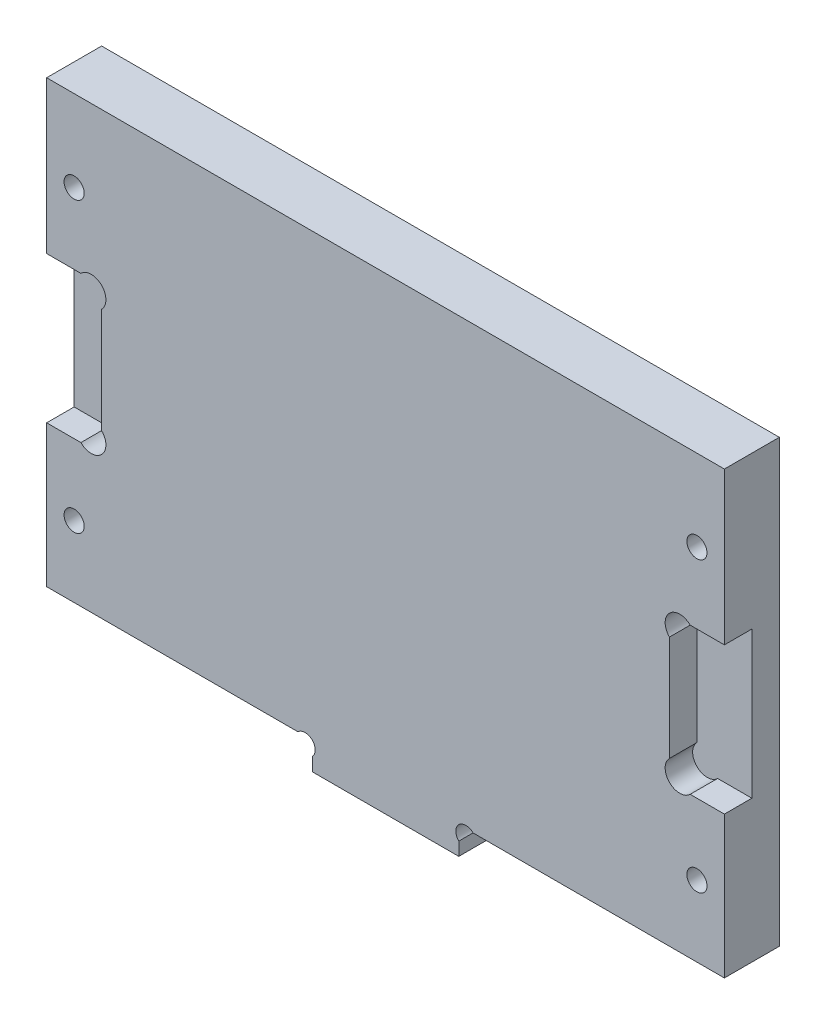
from build123d import *

# Parameters (mm, degrees)
ESQUISSE1_R             = 1.1
BOSS_EXTRU_1_DEPTH      = 6
ENL_V_MAT_EXTRU_1_DEPTH = 3


with BuildPart() as part:
    # Esquisse1 → Boss.-Extru.1 (new body)
    with BuildSketch(Plane.XY):
        with BuildLine():
            Line((0, 51.13), (74, 51.13))
            Line((74, 51.13), (74, 3))
            Line((74, 3), (46.555634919, 3))
            ThreePointArc((46.555634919, 3), (45, 3), (45, 1.444365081))
            Line((45, 1.444365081), (45, 0))
            Line((45, 0), (29, 0))
            Line((29, 0), (29, 1.444365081))
            ThreePointArc((29, 1.444365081), (29, 3), (27.444365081, 3))
            Line((27.444365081, 3), (0, 3))
            Line((0, 3), (0, 51.13))
        make_face()
        with Locations((71, 10.75)):
            Circle(ESQUISSE1_R, mode=Mode.SUBTRACT)
        with Locations(Location((71, 42.25, 0), (0, 0, 180))):
            Circle(ESQUISSE1_R, mode=Mode.SUBTRACT)
        with Locations(Location((3, 10.75, 0), (0, 0, 180))):
            Circle(ESQUISSE1_R, mode=Mode.SUBTRACT)
        with Locations((3, 42.25)):
            Circle(ESQUISSE1_R, mode=Mode.SUBTRACT)
    extrude(amount=BOSS_EXTRU_1_DEPTH)

    # Esquisse2 → Enl_v. mat.-Extru.1 (cut)
    with BuildSketch(Plane.XY.offset(6)):
        with BuildLine():
            Line((68, 32.2372583), (68, 20.7627417))
            ThreePointArc((68, 20.7627417), (68, 18.5), (70.2627417, 18.5))
            Line((70.2627417, 18.5), (74, 18.5))
            Line((74, 18.5), (74, 34.5))
            Line((74, 34.5), (70.2627417, 34.5))
            ThreePointArc((70.2627417, 34.5), (68, 34.5), (68, 32.2372583))
        make_face()
        with BuildLine():
            Line((0, 34.5), (0, 18.5))
            Line((0, 18.5), (3.7372583, 18.5))
            ThreePointArc((3.7372583, 18.5), (6, 18.5), (6, 20.7627417))
            Line((6, 20.7627417), (6, 32.2372583))
            ThreePointArc((6, 32.2372583), (6, 34.5), (3.7372583, 34.5))
            Line((3.7372583, 34.5), (0, 34.5))
        make_face()
    extrude(amount=-ENL_V_MAT_EXTRU_1_DEPTH, mode=Mode.SUBTRACT)


solid = part.part
